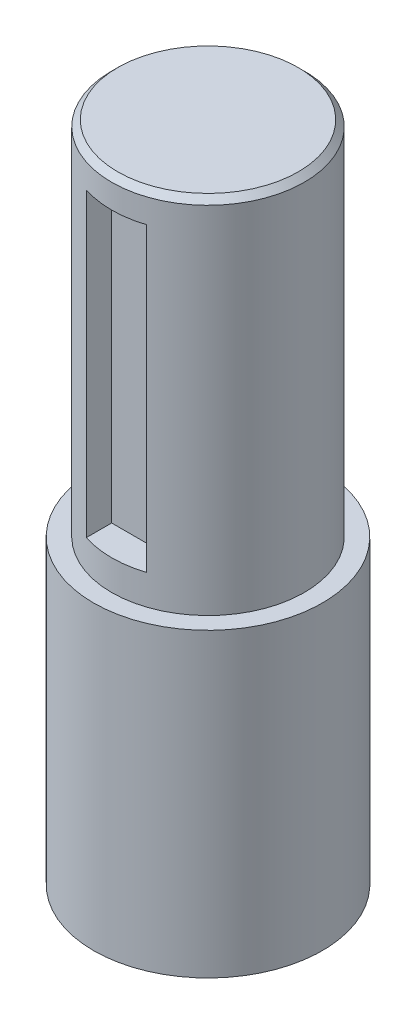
from build123d import *

# Parameters (mm, degrees)
SKETCH1_R           = 16
BOSS_EXTRUDE1_DEPTH = 60
CUT_EXTRUDE1_START  = 16
SKETCH2_W           = 10
SKETCH2_H           = 50
CUT_EXTRUDE1_DEPTH  = 5
SKETCH3_R           = 19
BOSS_EXTRUDE2_DEPTH = 50
CHAMFER1_SIZE       = 1


with BuildPart() as part:
    # Sketch1 → Boss-Extrude1 (new body)
    with BuildSketch(Plane(origin=(0, 0, 0), x_dir=(1, 0, 0), z_dir=(0, 1, 0))):
        with Locations(Location((0, 0, 0), (0, 0, 270))):
            Circle(SKETCH1_R)
    extrude(amount=BOSS_EXTRUDE1_DEPTH)

    # Sketch2 → Cut-Extrude1 (cut)
    with BuildSketch(Plane.XY.offset(CUT_EXTRUDE1_START)):
        with Locations((0, 30)):
            Rectangle(SKETCH2_W, SKETCH2_H)
    extrude(amount=-CUT_EXTRUDE1_DEPTH, mode=Mode.SUBTRACT)

    # Sketch3 → Boss-Extrude2 (add)
    with BuildSketch(Plane.XZ):
        with Locations(Location((0, 0, 0), (0, 0, 270))):
            Circle(SKETCH3_R)
    extrude(amount=BOSS_EXTRUDE2_DEPTH)

    # Chamfer1
    chamfer1_edges = [part.edges().sort_by_distance(p)[0] for p in [
        (0, 60, -16),
    ]]
    chamfer(chamfer1_edges, length=CHAMFER1_SIZE)


solid = part.part
